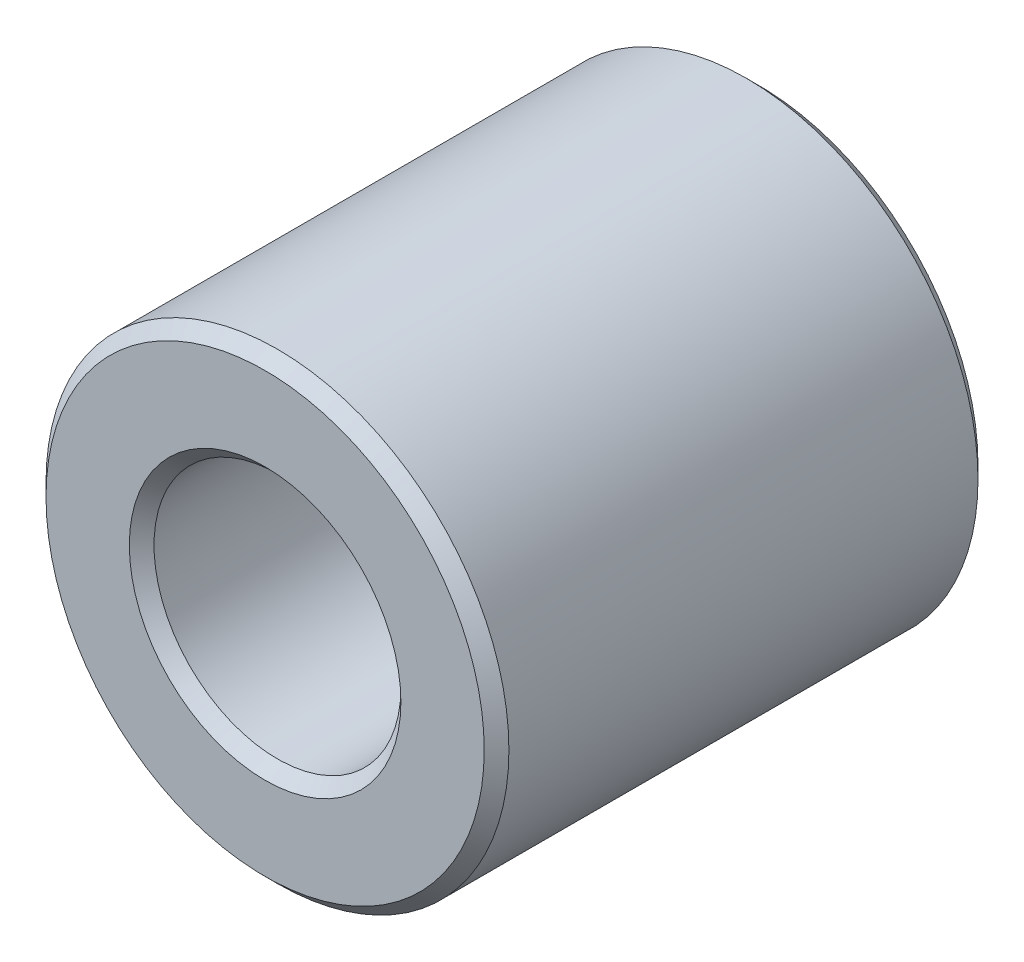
from build123d import *

# Parameters (mm, degrees)
SKETCH1_R           = 30
SKETCH1_R_2         = 16
BOSS_EXTRUDE1_DEPTH = 32
CHAMFER1_SIZE       = 1.6


with BuildPart() as part:
    # Sketch1 → Boss-Extrude1 (new, symmetric)
    with BuildSketch(Plane.XY):
        Circle(SKETCH1_R)
        Circle(SKETCH1_R_2, mode=Mode.SUBTRACT)
    extrude(amount=BOSS_EXTRUDE1_DEPTH, both=True)

    # Chamfer1
    chamfer1_edges = [part.edges().sort_by_distance(p)[0] for p in [
        (-30, 0, -32),
        (-30, 0, 32),
        (-16, 0, -32),
        (-16, 0, 32),
    ]]
    chamfer(chamfer1_edges, length=CHAMFER1_SIZE)


solid = part.part
